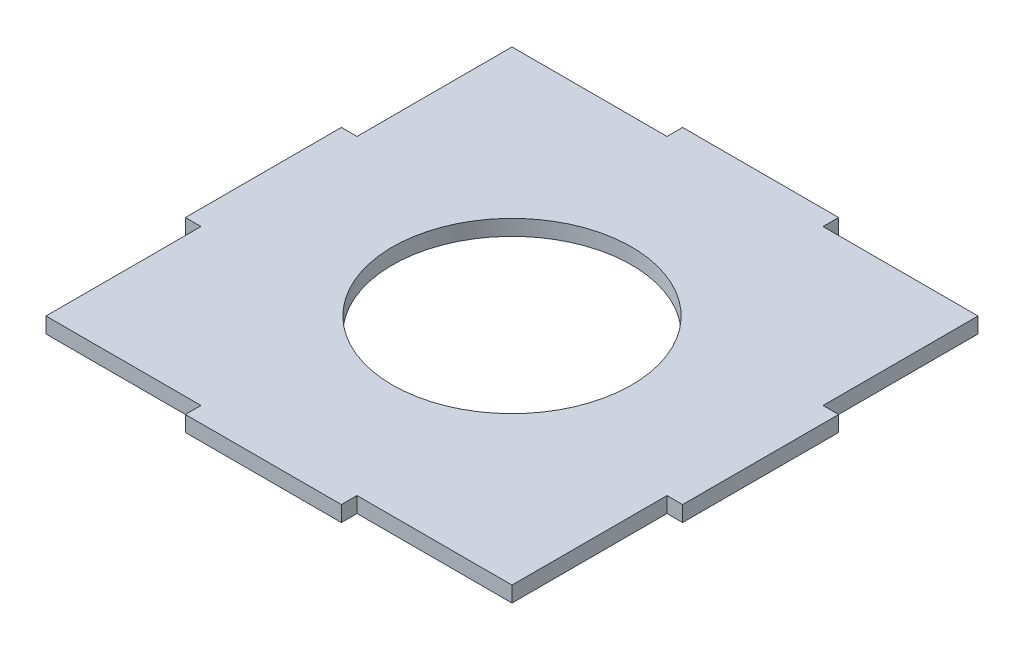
from build123d import *

# Parameters (mm, degrees)
SKETCH1_W           = 89.6
SKETCH1_H           = 89.6
BOSS_EXTRUDE1_DEPTH = 3
SKETCH2_W           = 3
SKETCH2_H           = 30
BOSS_EXTRUDE2_DEPTH = 3
CIRPATTERN1_COUNT   = 4
SKETCH4_R           = 23
CUT_EXTRUDE1_DEPTH  = 68.665944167


with BuildPart() as part:
    # Sketch1 → Boss-Extrude1 (new body)
    with BuildSketch(Plane(origin=(0, 0, 0), x_dir=(1, 0, 0), z_dir=(0, 1, 0))):
        Rectangle(SKETCH1_W, SKETCH1_H)
    extrude(amount=BOSS_EXTRUDE1_DEPTH)

    # Sketch2 → Boss-Extrude2 (add)
    with BuildSketch(Plane(origin=(0, 3, 0), x_dir=(1, 0, 0), z_dir=(0, 1, 0))):
        with Locations((-46.3, 0)):
            Rectangle(SKETCH2_W, SKETCH2_H)
    boss_extrude2 = extrude(amount=-BOSS_EXTRUDE2_DEPTH)

    # CirPattern1: Boss-Extrude2 ×4 about axis
    cirpattern1_axis = Axis((0, 0, 0), (0, 1, 0))
    for i in range(1, CIRPATTERN1_COUNT):
        add(boss_extrude2.rotate(cirpattern1_axis, i * 360 / CIRPATTERN1_COUNT))

    # Sketch4 → Cut-Extrude1 (cut, through all)
    with BuildSketch(Plane(origin=(0, 3, 0), x_dir=(1, 0, 0), z_dir=(0, 1, 0))):
        with Locations(Location((0, 0, 0), (0, 0, 270))):
            Circle(SKETCH4_R)
    extrude(amount=-CUT_EXTRUDE1_DEPTH, mode=Mode.SUBTRACT)


solid = part.part
